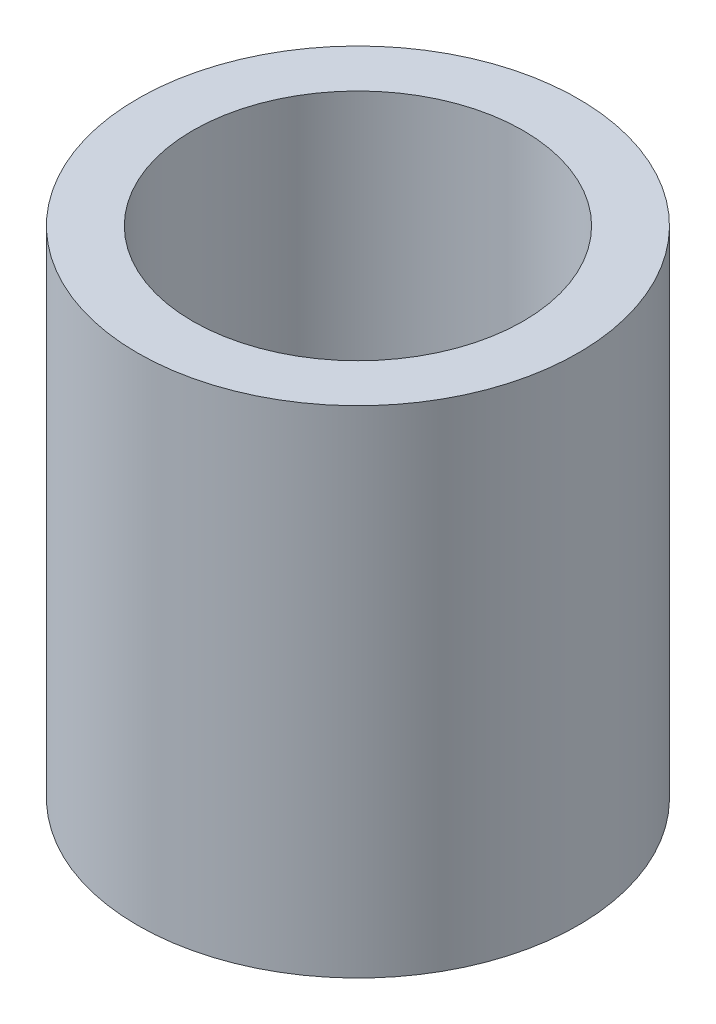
from build123d import *

# Parameters (mm, degrees)
SKETCH1_R           = 2
SKETCH1_R_2         = 1.5
BOSS_EXTRUDE1_DEPTH = 4.5


with BuildPart() as part:
    # Sketch1 → Boss-Extrude1 (new body)
    with BuildSketch(Plane(origin=(0, 0, 0), x_dir=(1, 0, 0), z_dir=(0, 1, 0))):
        with Locations(Location((0, 0, 0), (0, 0, 270))):
            Circle(SKETCH1_R)
        with Locations(Location((0, 0, 0), (0, 0, 270))):
            Circle(SKETCH1_R_2, mode=Mode.SUBTRACT)
    extrude(amount=BOSS_EXTRUDE1_DEPTH)


solid = part.part
